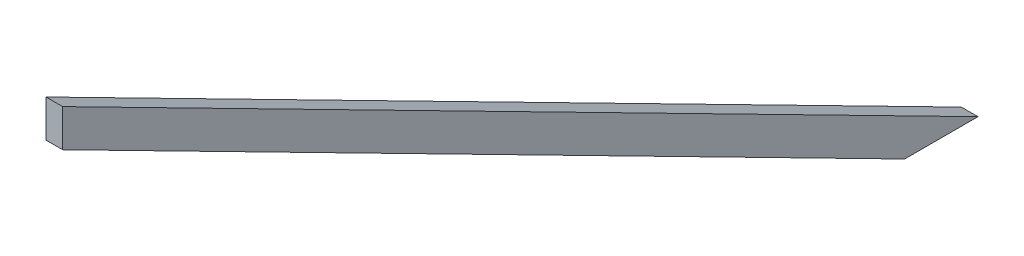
from build123d import *

# Parameters (mm, degrees)
EXTRUSION1_DEPTH = 5


with BuildPart() as part:
    # Esquisse1 → Extrusion1 (new body)
    with BuildSketch(Plane(origin=(0, 0, 0), x_dir=(0, 0, -1), z_dir=(1, 0, 0))):
        Polygon((335.1692163, -169.968785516), (357.196108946, -169.968785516), (82.249315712, -29.876397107), (82.249315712, -41.099659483), align=None)
    extrude(amount=EXTRUSION1_DEPTH)


solid = part.part
